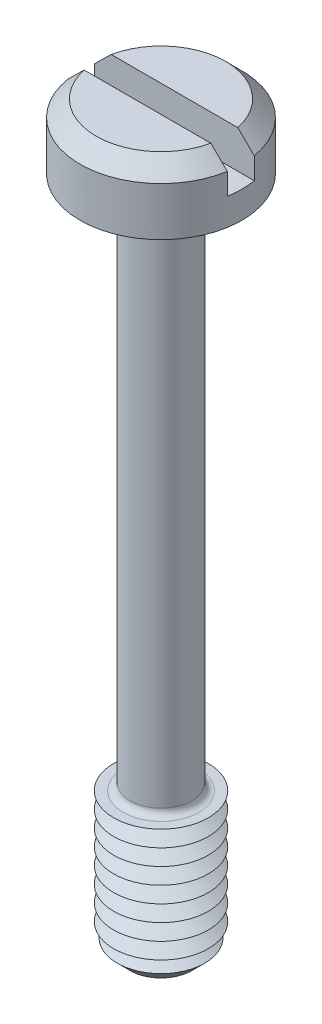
from build123d import *

# Parameters (mm, degrees)
SKETCH1_R           = 3
BOSS_EXTRUDE1_DEPTH = 2.4
SKETCH2_R           = 1.15
BOSS_EXTRUDE2_DEPTH = 25
SKETCH3_R           = 1.75
BOSS_EXTRUDE3_DEPTH = 5.2
CHAMFER1_SIZE       = 0.6
LPATTERN1_COUNT     = 8
LPATTERN1_PITCH     = 0.6
FILLET1_R           = 0.25
CHAMFER2_SIZE       = 0.6
SKETCH6_W           = 6
SKETCH6_H           = 1
CUT_EXTRUDE1_DEPTH  = 1.4


with BuildPart() as part:
    # Sketch1 → Boss-Extrude1 (new body)
    with BuildSketch(Plane(origin=(0, 0, 0), x_dir=(1, 0, 0), z_dir=(0, 1, 0))):
        with Locations(Location((0, 0, 0), (0, 0, 270))):
            Circle(SKETCH1_R)
    extrude(amount=BOSS_EXTRUDE1_DEPTH)

    # Sketch2 → Boss-Extrude2 (add)
    with BuildSketch(Plane.XZ):
        with Locations(Location((0, 0, 0), (0, 0, 270))):
            Circle(SKETCH2_R)
    extrude(amount=BOSS_EXTRUDE2_DEPTH)

    # Sketch3 → Boss-Extrude3 (add)
    with BuildSketch(Plane.XZ.offset(25)):
        with Locations(Location((0, 0, 0), (0, 0, 270))):
            Circle(SKETCH3_R)
    extrude(amount=-BOSS_EXTRUDE3_DEPTH)

    # Chamfer1
    chamfer1_edges = [part.edges().sort_by_distance(p)[0] for p in [
        (0, -25, 1.75),
    ]]
    chamfer(chamfer1_edges, length=CHAMFER1_SIZE)

    # Sketch5 → Cut-Revolve1 (revolve, cut)
    with BuildSketch(Plane(origin=(0, 0, 0), x_dir=(0, 0, -1), z_dir=(1, 0, 0))):
        Polygon((-1.75, -19.8), (-1.230384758, -20.1), (-1.75, -20.4), align=None)
    cut_revolve1 = revolve(axis=Axis((0, -6.58711856, 0), (0, -1, 0)), mode=Mode.SUBTRACT)

    # LPattern1: Cut-Revolve1 ×8
    with Locations(*[(0, -i * LPATTERN1_PITCH, 0) for i in range(1, LPATTERN1_COUNT)]):
        add(cut_revolve1, mode=Mode.SUBTRACT)

    # Fillet1
    fillet1_edges = [part.edges().sort_by_distance(p)[0] for p in [
        (0, 0, 1.15),
        (0, -19.8, 1.15),
    ]]
    fillet(fillet1_edges, radius=FILLET1_R)

    # Chamfer2
    chamfer2_edges = [part.edges().sort_by_distance(p)[0] for p in [
        (0, 2.4, -3),
    ]]
    chamfer(chamfer2_edges, length=CHAMFER2_SIZE)

    # Sketch6 → Cut-Extrude1 (cut)
    with BuildSketch(Plane(origin=(0, 2.4, 0), x_dir=(1, 0, 0), z_dir=(0, 1, 0))):
        Rectangle(SKETCH6_W, SKETCH6_H)
    extrude(amount=-CUT_EXTRUDE1_DEPTH, mode=Mode.SUBTRACT)


solid = part.part
